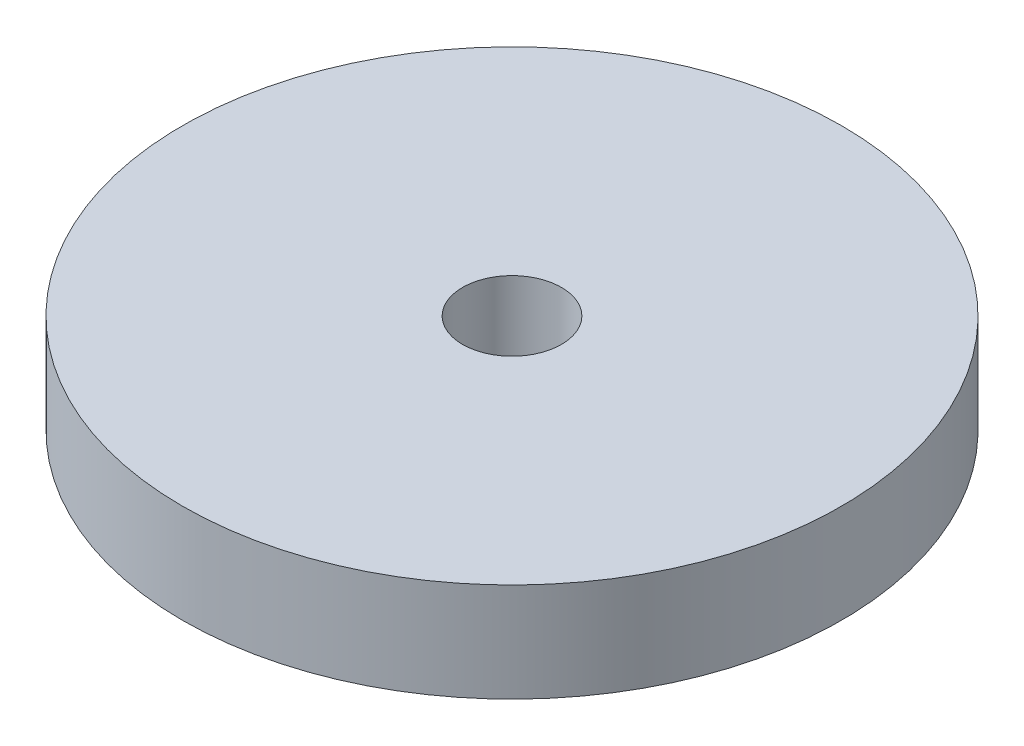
from build123d import *

# Parameters (mm, degrees)
ESQUISSE1_R             = 20
EXTRUSION1_DEPTH        = 6
ESQUISSE2_R             = 3
ENL_V_MAT_EXTRU_1_DEPTH = 29.91366459


with BuildPart() as part:
    # Esquisse1 → Extrusion1 (new body)
    with BuildSketch(Plane(origin=(0, 0, 0), x_dir=(1, 0, 0), z_dir=(0, 1, 0))):
        with Locations(Location((0, 0, 0), (0, 0, 270))):
            Circle(ESQUISSE1_R)
    extrude(amount=EXTRUSION1_DEPTH)

    # Esquisse2 → Enl_v. mat.-Extru.1 (cut, through all)
    with BuildSketch(Plane(origin=(0, 6, 0), x_dir=(-1, 0, 0), z_dir=(0, 1, 0))):
        with Locations(Location((0, 0, 0), (0, 0, 90))):
            Circle(ESQUISSE2_R)
    extrude(amount=-ENL_V_MAT_EXTRU_1_DEPTH, mode=Mode.SUBTRACT)


solid = part.part
